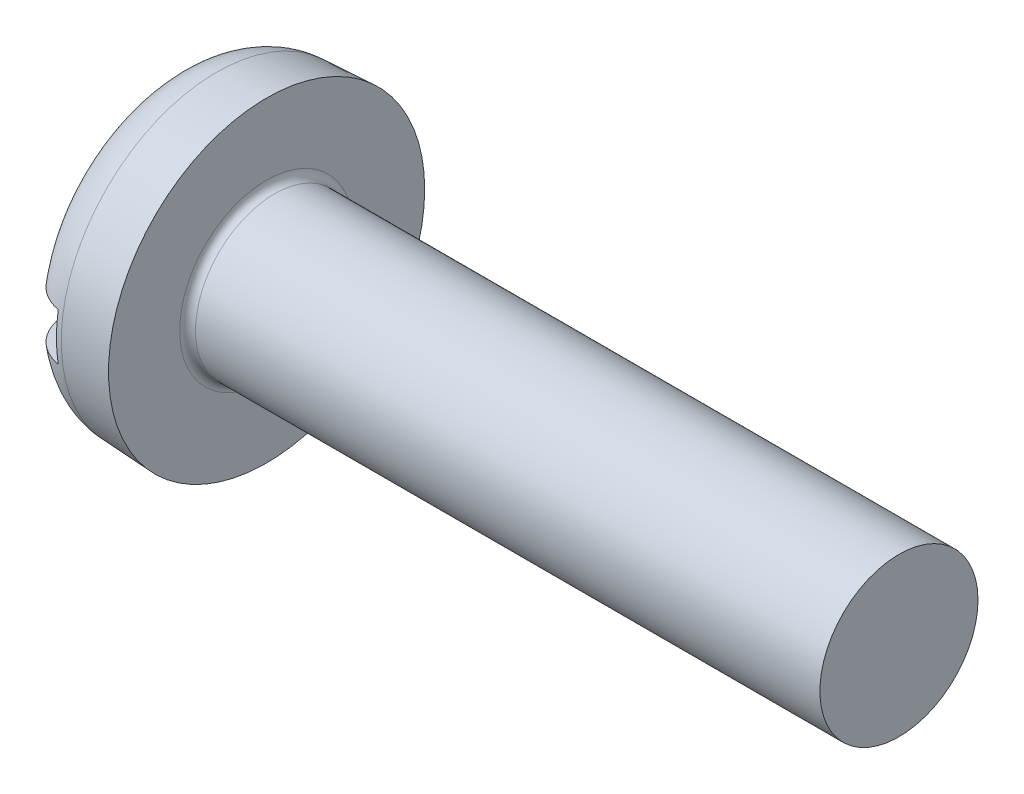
ISO-10303-21;
HEADER;
FILE_DESCRIPTION(('STEP AP214'),'2;1');
FILE_NAME('part.step','',(''),(''),'','','');
FILE_SCHEMA(('AUTOMOTIVE_DESIGN { 1 0 10303 214 1 1 1 1 }'));
ENDSEC;
DATA;
#1=APPLICATION_CONTEXT('core data for automotive mechanical design processes');
#2=APPLICATION_PROTOCOL_DEFINITION('international standard','automotive_design',2000,#1);
#3=PRODUCT_CONTEXT('',#1,'mechanical');
#4=PRODUCT('Part','Part','',(#3));
#5=PRODUCT_RELATED_PRODUCT_CATEGORY('part','',(#4));
#6=PRODUCT_DEFINITION_FORMATION('','',#4);
#7=PRODUCT_DEFINITION_CONTEXT('part definition',#1,'design');
#8=PRODUCT_DEFINITION('design','',#6,#7);
#9=PRODUCT_DEFINITION_SHAPE('','',#8);
#10=(LENGTH_UNIT() NAMED_UNIT(*) SI_UNIT(.MILLI.,.METRE.));
#11=(NAMED_UNIT(*) PLANE_ANGLE_UNIT() SI_UNIT($,.RADIAN.));
#12=(NAMED_UNIT(*) SI_UNIT($,.STERADIAN.) SOLID_ANGLE_UNIT());
#13=UNCERTAINTY_MEASURE_WITH_UNIT(LENGTH_MEASURE(1.E-05),#10,'distance_accuracy_value','');
#14=(GEOMETRIC_REPRESENTATION_CONTEXT(3) GLOBAL_UNCERTAINTY_ASSIGNED_CONTEXT((#13)) GLOBAL_UNIT_ASSIGNED_CONTEXT((#10,
#11,#12)) REPRESENTATION_CONTEXT('',''));
#15=CARTESIAN_POINT('',(0.,0.,0.));
#16=DIRECTION('',(0.,0.,1.));
#17=DIRECTION('',(1.,0.,0.));
#18=AXIS2_PLACEMENT_3D('',#15,#16,#17);
#19=CARTESIAN_POINT('',(0.,0.,0.));
#20=DIRECTION('',(1.,0.,0.));
#21=DIRECTION('',(0.,0.,-1.));
#22=AXIS2_PLACEMENT_3D('',#19,#20,#21);
#23=PLANE('',#22);
#24=CARTESIAN_POINT('',(0.,0.,0.));
#25=DIRECTION('',(1.,0.,0.));
#26=DIRECTION('',(0.,0.,-1.));
#27=AXIS2_PLACEMENT_3D('',#24,#25,#26);
#28=CIRCLE('',#27,2.73546384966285);
#29=CARTESIAN_POINT('',(0.,0.6,2.66885040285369));
#30=VERTEX_POINT('',#29);
#31=CARTESIAN_POINT('',(0.,0.6,-2.66885040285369));
#32=VERTEX_POINT('',#31);
#33=EDGE_CURVE('E104',#30,#32,#28,.F.);
#34=ORIENTED_EDGE('',*,*,#33,.T.);
#35=DIRECTION('',(0.,0.,1.));
#36=VECTOR('',#35,1.);
#37=CARTESIAN_POINT('',(0.,0.6,-4.));
#38=LINE('',#37,#36);
#39=EDGE_CURVE('E96',#32,#30,#38,.T.);
#40=ORIENTED_EDGE('',*,*,#39,.T.);
#41=EDGE_LOOP('',(#34,#40));
#42=FACE_BOUND('',#41,.T.);
#43=ADVANCED_FACE('F43',(#42),#23,.F.);
#44=CARTESIAN_POINT('',(2.4,0.,0.));
#45=DIRECTION('',(1.,0.,0.));
#46=DIRECTION('',(0.,0.,-1.));
#47=AXIS2_PLACEMENT_3D('',#44,#45,#46);
#48=PLANE('',#47);
#49=CARTESIAN_POINT('',(2.4,0.,0.));
#50=DIRECTION('',(1.,0.,0.));
#51=DIRECTION('',(0.,0.,-1.));
#52=AXIS2_PLACEMENT_3D('',#49,#50,#51);
#53=CIRCLE('',#52,2.2);
#54=CARTESIAN_POINT('',(2.4,0.,-2.2));
#55=VERTEX_POINT('',#54);
#56=EDGE_CURVE('E11',#55,#55,#53,.F.);
#57=ORIENTED_EDGE('',*,*,#56,.T.);
#58=EDGE_LOOP('',(#57));
#59=FACE_BOUND('',#58,.T.);
#60=CARTESIAN_POINT('',(2.4,0.,0.));
#61=DIRECTION('',(1.,0.,0.));
#62=DIRECTION('',(0.,0.,-1.));
#63=AXIS2_PLACEMENT_3D('',#60,#61,#62);
#64=CIRCLE('',#63,4.);
#65=CARTESIAN_POINT('',(2.4,0.,-4.));
#66=VERTEX_POINT('',#65);
#67=EDGE_CURVE('E178',#66,#66,#64,.T.);
#68=ORIENTED_EDGE('',*,*,#67,.T.);
#69=EDGE_LOOP('',(#68));
#70=FACE_BOUND('',#69,.T.);
#71=ADVANCED_FACE('F155',(#59,#70),#48,.T.);
#72=CARTESIAN_POINT('',(2.4,0.,0.));
#73=DIRECTION('',(1.,0.,0.));
#74=DIRECTION('',(0.,0.,-1.));
#75=AXIS2_PLACEMENT_3D('',#72,#73,#74);
#76=CONICAL_SURFACE('',#75,4.,0.05235987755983);
#77=CARTESIAN_POINT('',(1.13719685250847,0.,0.));
#78=DIRECTION('',(1.,0.,0.));
#79=DIRECTION('',(0.,0.,-1.));
#80=AXIS2_PLACEMENT_3D('',#77,#78,#79);
#81=CIRCLE('',#80,3.93381929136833);
#82=CARTESIAN_POINT('',(1.13719685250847,0.,-3.93381929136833));
#83=VERTEX_POINT('',#82);
#84=EDGE_CURVE('E108',#83,#83,#81,.T.);
#85=ORIENTED_EDGE('',*,*,#84,.T.);
#86=EDGE_LOOP('',(#85));
#87=FACE_BOUND('',#86,.T.);
#88=ORIENTED_EDGE('',*,*,#67,.F.);
#89=EDGE_LOOP('',(#88));
#90=FACE_BOUND('',#89,.T.);
#91=ADVANCED_FACE('F158',(#87,#90),#76,.T.);
#92=CARTESIAN_POINT('',(0.,-0.6,-2.66885040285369));
#93=VERTEX_POINT('',#92);
#94=CARTESIAN_POINT('',(0.,-0.6,2.66885040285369));
#95=VERTEX_POINT('',#94);
#96=EDGE_CURVE('E97',#93,#95,#28,.F.);
#97=ORIENTED_EDGE('',*,*,#96,.T.);
#98=DIRECTION('',(0.,0.,1.));
#99=VECTOR('',#98,1.);
#100=CARTESIAN_POINT('',(0.,-0.6,-4.));
#101=LINE('',#100,#99);
#102=EDGE_CURVE('E59',#93,#95,#101,.T.);
#103=ORIENTED_EDGE('',*,*,#102,.F.);
#104=EDGE_LOOP('',(#97,#103));
#105=FACE_BOUND('',#104,.T.);
#106=ADVANCED_FACE('F98',(#105),#23,.F.);
#107=CARTESIAN_POINT('',(18.4,0.,0.));
#108=DIRECTION('',(-1.,0.,0.));
#109=DIRECTION('',(0.,0.,1.));
#110=AXIS2_PLACEMENT_3D('',#107,#108,#109);
#111=CYLINDRICAL_SURFACE('',#110,2.);
#112=CARTESIAN_POINT('',(2.6,0.,0.));
#113=DIRECTION('',(1.,0.,0.));
#114=DIRECTION('',(0.,0.,-1.));
#115=AXIS2_PLACEMENT_3D('',#112,#113,#114);
#116=CIRCLE('',#115,2.);
#117=CARTESIAN_POINT('',(2.6,0.,-2.));
#118=VERTEX_POINT('',#117);
#119=EDGE_CURVE('E51',#118,#118,#116,.T.);
#120=ORIENTED_EDGE('',*,*,#119,.T.);
#121=EDGE_LOOP('',(#120));
#122=FACE_BOUND('',#121,.T.);
#123=CARTESIAN_POINT('',(18.4,0.,0.));
#124=DIRECTION('',(1.,0.,0.));
#125=DIRECTION('',(0.,0.,-1.));
#126=AXIS2_PLACEMENT_3D('',#123,#124,#125);
#127=CIRCLE('',#126,2.);
#128=CARTESIAN_POINT('',(18.4,0.,-2.));
#129=VERTEX_POINT('',#128);
#130=EDGE_CURVE('E181',#129,#129,#127,.T.);
#131=ORIENTED_EDGE('',*,*,#130,.F.);
#132=EDGE_LOOP('',(#131));
#133=FACE_BOUND('',#132,.T.);
#134=ADVANCED_FACE('F145',(#122,#133),#111,.T.);
#135=CARTESIAN_POINT('',(18.4,0.,0.));
#136=DIRECTION('',(1.,0.,0.));
#137=DIRECTION('',(0.,0.,-1.));
#138=AXIS2_PLACEMENT_3D('',#135,#136,#137);
#139=PLANE('',#138);
#140=ORIENTED_EDGE('',*,*,#130,.T.);
#141=EDGE_LOOP('',(#140));
#142=FACE_BOUND('',#141,.T.);
#143=ADVANCED_FACE('F166',(#142),#139,.T.);
#144=CARTESIAN_POINT('',(1.2,0.,0.));
#145=DIRECTION('',(1.,0.,0.));
#146=DIRECTION('',(0.,0.,-1.));
#147=AXIS2_PLACEMENT_3D('',#144,#145,#146);
#148=TOROIDAL_SURFACE('',#147,2.73546384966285,1.2);
#149=CARTESIAN_POINT('',(0.555933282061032,0.6,-3.69963697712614));
#150=CARTESIAN_POINT('',(0.612097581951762,0.6,-3.73582690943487));
#151=CARTESIAN_POINT('',(0.671342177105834,0.6,-3.76732291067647));
#152=CARTESIAN_POINT('',(0.794323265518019,0.6,-3.819955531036));
#153=CARTESIAN_POINT('',(0.858064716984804,0.6,-3.84108050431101));
#154=CARTESIAN_POINT('',(0.9881824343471,0.6,-3.87230357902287));
#155=CARTESIAN_POINT('',(1.05455798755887,0.6,-3.88240464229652));
#156=CARTESIAN_POINT('',(1.18804542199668,0.6,-3.89128144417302));
#157=CARTESIAN_POINT('',(1.2551571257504,0.6,-3.89005985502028));
#158=CARTESIAN_POINT('',(1.38803863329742,0.6,-3.87635428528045));
#159=CARTESIAN_POINT('',(1.45381153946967,0.6,-3.86390036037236));
#160=CARTESIAN_POINT('',(1.58233903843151,0.6,-3.82814160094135));
#161=CARTESIAN_POINT('',(1.6450935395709,0.6,-3.80483643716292));
#162=CARTESIAN_POINT('',(1.76590949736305,0.6,-3.74802277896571));
#163=CARTESIAN_POINT('',(1.82396400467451,0.6,-3.71449951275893));
#164=CARTESIAN_POINT('',(1.9336710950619,0.6,-3.63824661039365));
#165=CARTESIAN_POINT('',(1.98532354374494,0.6,-3.59551678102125));
#166=CARTESIAN_POINT('',(2.08116863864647,0.6,-3.50175800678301));
#167=CARTESIAN_POINT('',(2.12530590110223,0.6,-3.45067246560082));
#168=CARTESIAN_POINT('',(2.20450448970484,0.6,-3.34189724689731));
#169=CARTESIAN_POINT('',(2.23956537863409,0.6,-3.2842072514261));
#170=CARTESIAN_POINT('',(2.30012100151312,0.6,-3.1630762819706));
#171=CARTESIAN_POINT('',(2.32548641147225,0.6,-3.09957068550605));
#172=CARTESIAN_POINT('',(2.36541022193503,0.6,-2.96925219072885));
#173=CARTESIAN_POINT('',(2.37996773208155,0.6,-2.90243902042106));
#174=CARTESIAN_POINT('',(2.39816903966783,0.6,-2.7660769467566));
#175=CARTESIAN_POINT('',(2.40160452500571,0.6,-2.69650026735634));
#176=CARTESIAN_POINT('',(2.39701437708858,0.6,-2.55772811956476));
#177=CARTESIAN_POINT('',(2.38898742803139,0.6,-2.48853269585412));
#178=CARTESIAN_POINT('',(2.36150000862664,0.6,-2.3508493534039));
#179=CARTESIAN_POINT('',(2.34178924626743,0.6,-2.28241138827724));
#180=CARTESIAN_POINT('',(2.29136170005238,0.6,-2.14971365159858));
#181=CARTESIAN_POINT('',(2.26064332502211,0.6,-2.08545448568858));
#182=CARTESIAN_POINT('',(2.18841822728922,0.6,-1.96178172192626));
#183=CARTESIAN_POINT('',(2.14673117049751,0.6,-1.90247329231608));
#184=CARTESIAN_POINT('',(2.05392478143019,0.6,-1.79173471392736));
#185=CARTESIAN_POINT('',(2.00280414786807,0.6,-1.74030565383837));
#186=CARTESIAN_POINT('',(1.8928415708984,0.6,-1.64738954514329));
#187=CARTESIAN_POINT('',(1.83405992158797,0.6,-1.60583135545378));
#188=CARTESIAN_POINT('',(1.71003406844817,0.6,-1.53383571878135));
#189=CARTESIAN_POINT('',(1.64479280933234,0.6,-1.50339323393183));
#190=CARTESIAN_POINT('',(1.51349434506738,0.6,-1.45646687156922));
#191=CARTESIAN_POINT('',(1.4476792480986,0.6,-1.43930752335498));
#192=CARTESIAN_POINT('',(1.31404018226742,0.6,-1.41721626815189));
#193=CARTESIAN_POINT('',(1.24621741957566,0.6,-1.41227716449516));
#194=CARTESIAN_POINT('',(1.1155159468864,0.6,-1.41481386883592));
#195=CARTESIAN_POINT('',(1.05261935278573,0.6,-1.42145563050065));
#196=CARTESIAN_POINT('',(0.928843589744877,0.6,-1.44521901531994));
#197=CARTESIAN_POINT('',(0.867964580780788,0.6,-1.46234146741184));
#198=CARTESIAN_POINT('',(0.7498264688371,0.6,-1.50626762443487));
#199=CARTESIAN_POINT('',(0.692567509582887,0.6,-1.53307171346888));
#200=CARTESIAN_POINT('',(0.582966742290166,0.6,-1.59532349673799));
#201=CARTESIAN_POINT('',(0.530626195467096,0.6,-1.63077339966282));
#202=CARTESIAN_POINT('',(0.428649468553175,0.6,-1.71181800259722));
#203=CARTESIAN_POINT('',(0.379425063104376,0.6,-1.75793082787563));
#204=CARTESIAN_POINT('',(0.28887643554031,0.6,-1.85735292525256));
#205=CARTESIAN_POINT('',(0.247554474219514,0.6,-1.91066424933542));
#206=CARTESIAN_POINT('',(0.171571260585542,0.6,-2.0264003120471));
#207=CARTESIAN_POINT('',(0.137443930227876,0.6,-2.0891764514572));
#208=CARTESIAN_POINT('',(0.0800179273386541,0.6,-2.21950517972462));
#209=CARTESIAN_POINT('',(0.0567205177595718,0.6,-2.28705832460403));
#210=CARTESIAN_POINT('',(0.0213897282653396,0.6,-2.42619403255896));
#211=CARTESIAN_POINT('',(0.00953960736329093,0.6,-2.49782331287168));
#212=CARTESIAN_POINT('',(-0.0017807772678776,0.6,-2.64205497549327));
#213=CARTESIAN_POINT('',(-0.00125216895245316,0.6,-2.71465726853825));
#214=CARTESIAN_POINT('',(0.0122145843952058,0.6,-2.85765418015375));
#215=CARTESIAN_POINT('',(0.0249745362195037,0.6,-2.92806552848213));
#216=CARTESIAN_POINT('',(0.0624173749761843,0.6,-3.06566752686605));
#217=CARTESIAN_POINT('',(0.0871019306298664,0.6,-3.13285772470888));
#218=CARTESIAN_POINT('',(0.147094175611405,0.6,-3.26049536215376));
#219=CARTESIAN_POINT('',(0.18215501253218,0.6,-3.32105900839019));
#220=CARTESIAN_POINT('',(0.262119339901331,0.6,-3.43522071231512));
#221=CARTESIAN_POINT('',(0.307009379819,0.6,-3.488828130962));
#222=CARTESIAN_POINT('',(0.386440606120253,0.6,-3.56852120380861));
#223=CARTESIAN_POINT('',(0.418349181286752,0.6,-3.59727767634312));
#224=CARTESIAN_POINT('',(0.485059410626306,0.6,-3.65121381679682));
#225=CARTESIAN_POINT('',(0.519861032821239,0.6,-3.67639352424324));
#226=CARTESIAN_POINT('',(0.555933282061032,0.6,-3.69963697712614));
#227=B_SPLINE_CURVE_WITH_KNOTS('',3,(#149,#150,#151,#152,#153,#154,#155,#156,#157,#158,#159,
#160,#161,#162,#163,#164,#165,#166,#167,#168,#169,#170,#171,#172,#173,#174,#175,#176,#177,#178,
#179,#180,#181,#182,#183,#184,#185,#186,#187,#188,#189,#190,#191,#192,#193,#194,#195,#196,#197,
#198,#199,#200,#201,#202,#203,#204,#205,#206,#207,#208,#209,#210,#211,#212,#213,#214,#215,#216,
#217,#218,#219,#220,#221,#222,#223,#224,#225,#226),.UNSPECIFIED.,.T.,.F.,(4,2,2,2,2,2,2,2,2,2,2,
2,2,2,2,2,2,2,2,2,2,2,2,2,2,2,2,2,2,2,2,2,2,2,2,2,2,2,4),(0.,0.20028700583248,0.40079840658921,
0.601255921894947,0.80166612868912,1.00154166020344,1.20142325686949,1.40159519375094,
1.60177133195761,1.80336420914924,2.00496679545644,2.2091717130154,2.41339345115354,
2.62141871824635,2.82946786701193,3.04214366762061,3.25485022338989,3.47129985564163,
3.68777936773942,3.90264781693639,4.11741876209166,4.32038062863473,4.52322293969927,
4.71205300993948,4.90089801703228,5.08975051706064,5.27865131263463,5.48012321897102,
5.68165267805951,5.89502164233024,6.10841548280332,6.32517154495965,6.54190785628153,
6.75553387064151,6.96918978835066,7.17812345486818,7.38677297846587,7.51541132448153,
7.64404824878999),.UNSPECIFIED.);
#228=CARTESIAN_POINT('',(1.,0.6,-3.87247355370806));
#229=VERTEX_POINT('',#228);
#230=EDGE_CURVE('E132',#32,#229,#227,.T.);
#231=ORIENTED_EDGE('',*,*,#230,.F.);
#232=ORIENTED_EDGE('',*,*,#33,.F.);
#233=CARTESIAN_POINT('',(0.515582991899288,0.6,1.64369364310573));
#234=CARTESIAN_POINT('',(0.568128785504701,0.6,1.60485500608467));
#235=CARTESIAN_POINT('',(0.623793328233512,0.6,1.57018612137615));
#236=CARTESIAN_POINT('',(0.740097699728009,0.6,1.51044666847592));
#237=CARTESIAN_POINT('',(0.800739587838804,0.6,1.48538009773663));
#238=CARTESIAN_POINT('',(0.925598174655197,0.6,1.44591759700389));
#239=CARTESIAN_POINT('',(0.989823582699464,0.6,1.43154900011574));
#240=CARTESIAN_POINT('',(1.11978889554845,0.6,1.41436102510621));
#241=CARTESIAN_POINT('',(1.18552814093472,0.6,1.41153671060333));
#242=CARTESIAN_POINT('',(1.31369263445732,0.6,1.4174549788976));
#243=CARTESIAN_POINT('',(1.37614083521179,0.6,1.42571534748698));
#244=CARTESIAN_POINT('',(1.49878010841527,0.6,1.4525366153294));
#245=CARTESIAN_POINT('',(1.55897082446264,0.6,1.47109913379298));
#246=CARTESIAN_POINT('',(1.67598712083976,0.6,1.51786066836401));
#247=CARTESIAN_POINT('',(1.73278411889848,0.6,1.5461308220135));
#248=CARTESIAN_POINT('',(1.84124862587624,0.6,1.61120742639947));
#249=CARTESIAN_POINT('',(1.89291480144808,0.6,1.64801608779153));
#250=CARTESIAN_POINT('',(1.99339521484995,0.6,1.731821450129));
#251=CARTESIAN_POINT('',(2.04177148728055,0.6,1.77934340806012));
#252=CARTESIAN_POINT('',(2.13038749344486,0.6,1.88145058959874));
#253=CARTESIAN_POINT('',(2.17062497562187,0.6,1.93603776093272));
#254=CARTESIAN_POINT('',(2.24403971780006,0.6,2.05407203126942));
#255=CARTESIAN_POINT('',(2.27669611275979,0.6,2.11784393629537));
#256=CARTESIAN_POINT('',(2.33099926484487,0.6,2.24991940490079));
#257=CARTESIAN_POINT('',(2.35264491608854,0.6,2.31822342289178));
#258=CARTESIAN_POINT('',(2.38444660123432,0.6,2.45837823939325));
#259=CARTESIAN_POINT('',(2.3944534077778,0.6,2.53026303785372));
#260=CARTESIAN_POINT('',(2.40205371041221,0.6,2.67468993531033));
#261=CARTESIAN_POINT('',(2.39964795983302,0.6,2.74723199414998));
#262=CARTESIAN_POINT('',(2.38248365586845,0.6,2.88970050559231));
#263=CARTESIAN_POINT('',(2.36791749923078,0.6,2.95965008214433));
#264=CARTESIAN_POINT('',(2.32697297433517,0.6,3.09600502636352));
#265=CARTESIAN_POINT('',(2.30059599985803,0.6,3.16241081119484));
#266=CARTESIAN_POINT('',(2.23743033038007,0.6,3.28819082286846));
#267=CARTESIAN_POINT('',(2.20089069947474,0.6,3.34769014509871));
#268=CARTESIAN_POINT('',(2.11815515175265,0.6,3.45954830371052));
#269=CARTESIAN_POINT('',(2.0719602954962,0.6,3.51190792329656));
#270=CARTESIAN_POINT('',(1.9722029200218,0.6,3.60693861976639));
#271=CARTESIAN_POINT('',(1.91880027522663,0.6,3.64977757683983));
#272=CARTESIAN_POINT('',(1.80548008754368,0.6,3.72573720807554));
#273=CARTESIAN_POINT('',(1.74556306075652,0.6,3.75885865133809));
#274=CARTESIAN_POINT('',(1.62178095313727,0.6,3.81399882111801));
#275=CARTESIAN_POINT('',(1.55797916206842,0.6,3.83615969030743));
#276=CARTESIAN_POINT('',(1.42754632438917,0.6,3.8693676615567));
#277=CARTESIAN_POINT('',(1.3609154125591,0.6,3.88041529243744));
#278=CARTESIAN_POINT('',(1.22723269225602,0.6,3.89102498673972));
#279=CARTESIAN_POINT('',(1.16018742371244,0.6,3.89066962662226));
#280=CARTESIAN_POINT('',(1.02711260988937,0.6,3.8786886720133));
#281=CARTESIAN_POINT('',(0.9610830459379,0.6,3.86706328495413));
#282=CARTESIAN_POINT('',(0.832014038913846,0.6,3.83291537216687));
#283=CARTESIAN_POINT('',(0.768970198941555,0.6,3.8104094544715));
#284=CARTESIAN_POINT('',(0.647534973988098,0.6,3.75517384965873));
#285=CARTESIAN_POINT('',(0.58914362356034,0.6,3.7224440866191));
#286=CARTESIAN_POINT('',(0.478404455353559,0.6,3.64756873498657));
#287=CARTESIAN_POINT('',(0.426081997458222,0.6,3.60538565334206));
#288=CARTESIAN_POINT('',(0.329178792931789,0.6,3.51291088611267));
#289=CARTESIAN_POINT('',(0.284598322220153,0.6,3.46261891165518));
#290=CARTESIAN_POINT('',(0.203960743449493,0.6,3.35484539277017));
#291=CARTESIAN_POINT('',(0.167990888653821,0.6,3.29729858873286));
#292=CARTESIAN_POINT('',(0.106054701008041,0.6,3.17705572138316));
#293=CARTESIAN_POINT('',(0.0800890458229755,0.6,3.1143593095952));
#294=CARTESIAN_POINT('',(0.0384437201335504,0.6,2.9845572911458));
#295=CARTESIAN_POINT('',(0.0229313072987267,0.6,2.91739805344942));
#296=CARTESIAN_POINT('',(0.0031545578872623,0.6,2.78144902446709));
#297=CARTESIAN_POINT('',(-0.00110911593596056,0.6,2.71265913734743));
#298=CARTESIAN_POINT('',(0.00162760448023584,0.6,2.57388041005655));
#299=CARTESIAN_POINT('',(0.00886300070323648,0.6,2.50389622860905));
#300=CARTESIAN_POINT('',(0.0347230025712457,0.6,2.3660479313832));
#301=CARTESIAN_POINT('',(0.053351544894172,0.6,2.29818455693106));
#302=CARTESIAN_POINT('',(0.101943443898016,0.6,2.16494106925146));
#303=CARTESIAN_POINT('',(0.132148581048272,0.6,2.09964917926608));
#304=CARTESIAN_POINT('',(0.202971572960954,0.6,1.97502953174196));
#305=CARTESIAN_POINT('',(0.243580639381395,0.6,1.91569679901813));
#306=CARTESIAN_POINT('',(0.321961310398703,0.6,1.81959577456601));
#307=CARTESIAN_POINT('',(0.35757140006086,0.6,1.78104429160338));
#308=CARTESIAN_POINT('',(0.433313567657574,0.6,1.70866604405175));
#309=CARTESIAN_POINT('',(0.473445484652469,0.6,1.67483911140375));
#310=CARTESIAN_POINT('',(0.515582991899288,0.6,1.64369364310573));
#311=B_SPLINE_CURVE_WITH_KNOTS('',3,(#233,#234,#235,#236,#237,#238,#239,#240,#241,#242,#243,
#244,#245,#246,#247,#248,#249,#250,#251,#252,#253,#254,#255,#256,#257,#258,#259,#260,#261,#262,
#263,#264,#265,#266,#267,#268,#269,#270,#271,#272,#273,#274,#275,#276,#277,#278,#279,#280,#281,
#282,#283,#284,#285,#286,#287,#288,#289,#290,#291,#292,#293,#294,#295,#296,#297,#298,#299,#300,
#301,#302,#303,#304,#305,#306,#307,#308,#309,#310),.UNSPECIFIED.,.T.,.F.,(4,2,2,2,2,2,2,2,2,2,2,
2,2,2,2,2,2,2,2,2,2,2,2,2,2,2,2,2,2,2,2,2,2,2,2,2,2,2,4),(0.,0.195852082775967,
0.391785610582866,0.588218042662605,0.784566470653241,0.972644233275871,1.16075156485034,
1.35026785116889,1.53983325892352,1.74238727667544,1.94499725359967,2.15894126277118,
2.37290675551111,2.58958637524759,2.80625284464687,3.01955487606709,3.2328317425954,
3.44128327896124,3.64971193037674,3.85410717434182,4.05848623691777,4.26014035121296,
4.46178486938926,4.66196948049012,4.86215040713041,5.06202673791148,5.26190455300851,
5.46258959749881,5.6632817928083,5.86592886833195,6.06858966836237,6.27442069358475,
6.48026384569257,6.69036810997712,6.90054501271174,7.11537441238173,7.3300229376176,
7.48708617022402,7.64414381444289),.UNSPECIFIED.);
#312=CARTESIAN_POINT('',(1.,0.6,3.87247355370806));
#313=VERTEX_POINT('',#312);
#314=EDGE_CURVE('E94',#313,#30,#311,.T.);
#315=ORIENTED_EDGE('',*,*,#314,.F.);
#316=CARTESIAN_POINT('',(1.,0.,0.));
#317=DIRECTION('',(1.,0.,0.));
#318=DIRECTION('',(0.,0.,-1.));
#319=AXIS2_PLACEMENT_3D('',#316,#317,#318);
#320=CIRCLE('',#319,3.91867980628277);
#321=CARTESIAN_POINT('',(1.,-0.6,3.87247355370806));
#322=VERTEX_POINT('',#321);
#323=EDGE_CURVE('E68',#322,#313,#320,.F.);
#324=ORIENTED_EDGE('',*,*,#323,.F.);
#325=CARTESIAN_POINT('',(0.515582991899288,-0.6,1.64369364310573));
#326=CARTESIAN_POINT('',(0.458216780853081,-0.6,1.68610027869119));
#327=CARTESIAN_POINT('',(0.404486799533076,-0.6,1.73354170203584));
#328=CARTESIAN_POINT('',(0.305710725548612,-0.6,1.83684214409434));
#329=CARTESIAN_POINT('',(0.260681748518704,-0.6,1.89271737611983));
#330=CARTESIAN_POINT('',(0.180588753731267,-0.6,2.01107750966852));
#331=CARTESIAN_POINT('',(0.145508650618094,-0.6,2.07355151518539));
#332=CARTESIAN_POINT('',(0.0861851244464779,-0.6,2.2034121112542));
#333=CARTESIAN_POINT('',(0.0619367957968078,-0.6,2.27079646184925));
#334=CARTESIAN_POINT('',(0.0247322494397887,-0.6,2.40960591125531));
#335=CARTESIAN_POINT('',(0.0119339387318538,-0.6,2.48107347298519));
#336=CARTESIAN_POINT('',(-0.00130824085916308,-0.6,2.62515575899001));
#337=CARTESIAN_POINT('',(-0.00175150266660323,-0.6,2.6977705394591));
#338=CARTESIAN_POINT('',(0.00979769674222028,-0.6,2.84101713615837));
#339=CARTESIAN_POINT('',(0.0216215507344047,-0.6,2.91166248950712));
#340=CARTESIAN_POINT('',(0.0572406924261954,-0.6,3.04987000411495));
#341=CARTESIAN_POINT('',(0.0810344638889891,-0.6,3.1174325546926));
#342=CARTESIAN_POINT('',(0.139334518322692,-0.6,3.2459308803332));
#343=CARTESIAN_POINT('',(0.173587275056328,-0.6,3.30698169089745));
#344=CARTESIAN_POINT('',(0.252054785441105,-0.6,3.42230688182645));
#345=CARTESIAN_POINT('',(0.296268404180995,-0.6,3.47658203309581));
#346=CARTESIAN_POINT('',(0.392437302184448,-0.6,3.57567757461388));
#347=CARTESIAN_POINT('',(0.444220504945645,-0.6,3.62066501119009));
#348=CARTESIAN_POINT('',(0.554696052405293,-0.6,3.70115846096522));
#349=CARTESIAN_POINT('',(0.613387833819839,-0.6,3.73666524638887));
#350=CARTESIAN_POINT('',(0.735119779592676,-0.6,3.79668379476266));
#351=CARTESIAN_POINT('',(0.798087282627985,-0.6,3.82134299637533));
#352=CARTESIAN_POINT('',(0.927287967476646,-0.6,3.85964469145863));
#353=CARTESIAN_POINT('',(0.993520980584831,-0.6,3.87328775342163));
#354=CARTESIAN_POINT('',(1.12680970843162,-0.6,3.88908201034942));
#355=CARTESIAN_POINT('',(1.1938547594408,-0.6,3.89132332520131));
#356=CARTESIAN_POINT('',(1.3273648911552,-0.6,3.8844911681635));
#357=CARTESIAN_POINT('',(1.39382998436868,-0.6,3.87541794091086));
#358=CARTESIAN_POINT('',(1.52414639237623,-0.6,3.84625981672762));
#359=CARTESIAN_POINT('',(1.5880030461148,-0.6,3.82619876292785));
#360=CARTESIAN_POINT('',(1.71145793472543,-0.6,3.77567575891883));
#361=CARTESIAN_POINT('',(1.77105614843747,-0.599999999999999,3.74521375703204));
#362=CARTESIAN_POINT('',(1.88453260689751,-0.599999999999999,3.67466350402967));
#363=CARTESIAN_POINT('',(1.93839071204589,-0.599999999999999,3.63454287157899));
#364=CARTESIAN_POINT('',(2.03868103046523,-0.599999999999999,3.54590356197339));
#365=CARTESIAN_POINT('',(2.08511300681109,-0.599999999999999,3.49738461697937));
#366=CARTESIAN_POINT('',(2.16970278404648,-0.599999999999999,3.39287085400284));
#367=CARTESIAN_POINT('',(2.20778164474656,-0.599999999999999,3.33681216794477));
#368=CARTESIAN_POINT('',(2.27414536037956,-0.599999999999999,3.21917351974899));
#369=CARTESIAN_POINT('',(2.30242962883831,-0.599999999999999,3.15759322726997));
#370=CARTESIAN_POINT('',(2.34887457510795,-0.599999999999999,3.0296840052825));
#371=CARTESIAN_POINT('',(2.36687749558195,-0.599999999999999,2.96329782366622));
#372=CARTESIAN_POINT('',(2.39172314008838,-0.599999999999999,2.82847203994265));
#373=CARTESIAN_POINT('',(2.39856480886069,-0.599999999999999,2.76003224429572));
#374=CARTESIAN_POINT('',(2.40105335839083,-0.599999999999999,2.62155982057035));
#375=CARTESIAN_POINT('',(2.39647001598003,-0.599999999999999,2.55152307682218));
#376=CARTESIAN_POINT('',(2.37587536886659,-0.599999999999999,2.41315158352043));
#377=CARTESIAN_POINT('',(2.35986267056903,-0.599999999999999,2.34481704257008));
#378=CARTESIAN_POINT('',(2.31645872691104,-0.599999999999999,2.21019244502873));
#379=CARTESIAN_POINT('',(2.28882422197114,-0.599999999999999,2.14398076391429));
#380=CARTESIAN_POINT('',(2.22296516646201,-0.599999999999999,2.01704107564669));
#381=CARTESIAN_POINT('',(2.18473885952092,-0.599999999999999,1.95631398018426));
#382=CARTESIAN_POINT('',(2.09818730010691,-0.599999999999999,1.84138532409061));
#383=CARTESIAN_POINT('',(2.04974718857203,-0.599999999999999,1.78727009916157));
#384=CARTESIAN_POINT('',(1.94428163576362,-0.599999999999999,1.6881426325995));
#385=CARTESIAN_POINT('',(1.88725605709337,-0.599999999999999,1.64313053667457));
#386=CARTESIAN_POINT('',(1.76747975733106,-0.599999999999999,1.5648167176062));
#387=CARTESIAN_POINT('',(1.7048877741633,-0.6,1.53127307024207));
#388=CARTESIAN_POINT('',(1.57467690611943,-0.6,1.47606198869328));
#389=CARTESIAN_POINT('',(1.50706164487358,-0.6,1.4543860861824));
#390=CARTESIAN_POINT('',(1.37369033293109,-0.6,1.42514404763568));
#391=CARTESIAN_POINT('',(1.30812360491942,-0.6,1.41671398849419));
#392=CARTESIAN_POINT('',(1.17652664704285,-0.6,1.4116726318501));
#393=CARTESIAN_POINT('',(1.11049644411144,-0.6,1.41506065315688));
#394=CARTESIAN_POINT('',(0.983521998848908,-0.6,1.43296581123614));
#395=CARTESIAN_POINT('',(0.922492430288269,-0.6,1.44689126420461));
#396=CARTESIAN_POINT('',(0.803577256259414,-0.6,1.48449116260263));
#397=CARTESIAN_POINT('',(0.7456883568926,-0.6,1.50815516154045));
#398=CARTESIAN_POINT('',(0.659511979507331,-0.6,1.55158165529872));
#399=CARTESIAN_POINT('',(0.629644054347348,-0.6,1.56829420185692));
#400=CARTESIAN_POINT('',(0.571433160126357,-0.6,1.60418332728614));
#401=CARTESIAN_POINT('',(0.543090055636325,-0.6,1.62335968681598));
#402=CARTESIAN_POINT('',(0.515582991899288,-0.6,1.64369364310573));
#403=B_SPLINE_CURVE_WITH_KNOTS('',3,(#325,#326,#327,#328,#329,#330,#331,#332,#333,#334,#335,
#336,#337,#338,#339,#340,#341,#342,#343,#344,#345,#346,#347,#348,#349,#350,#351,#352,#353,#354,
#355,#356,#357,#358,#359,#360,#361,#362,#363,#364,#365,#366,#367,#368,#369,#370,#371,#372,#373,
#374,#375,#376,#377,#378,#379,#380,#381,#382,#383,#384,#385,#386,#387,#388,#389,#390,#391,#392,
#393,#394,#395,#396,#397,#398,#399,#400,#401,#402),.UNSPECIFIED.,.T.,.F.,(4,2,2,2,2,2,2,2,2,2,2,
2,2,2,2,2,2,2,2,2,2,2,2,2,2,2,2,2,2,2,2,2,2,2,2,2,2,2,4),(0.,0.213886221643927,
0.428188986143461,0.64214326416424,0.856000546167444,1.07276359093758,1.28953728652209,
1.50337047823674,1.71717659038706,1.92616391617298,2.13512744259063,2.33992141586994,
2.54469870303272,2.7465995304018,2.94848993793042,3.14878208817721,3.34906990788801,
3.5489248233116,3.74878073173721,3.94931623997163,4.1498581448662,4.35222058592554,
4.55459514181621,4.75999682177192,4.96541792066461,5.1750117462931,5.38463113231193,
5.59887553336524,5.81315548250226,6.02998757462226,6.2468231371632,6.45875238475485,
6.67053021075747,6.86781811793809,7.06509465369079,7.2520473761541,7.43880007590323,
7.54136751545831,7.6439258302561),.UNSPECIFIED.);
#404=EDGE_CURVE('E101',#95,#322,#403,.T.);
#405=ORIENTED_EDGE('',*,*,#404,.F.);
#406=ORIENTED_EDGE('',*,*,#96,.F.);
#407=CARTESIAN_POINT('',(0.555933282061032,-0.6,-3.69963697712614));
#408=CARTESIAN_POINT('',(0.498937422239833,-0.6,-3.66290380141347));
#409=CARTESIAN_POINT('',(0.445028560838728,-0.6,-3.62128013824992));
#410=CARTESIAN_POINT('',(0.344954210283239,-0.6,-3.52950231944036));
#411=CARTESIAN_POINT('',(0.298799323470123,-0.6,-3.47933666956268));
#412=CARTESIAN_POINT('',(0.21558827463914,-0.6,-3.37204086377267));
#413=CARTESIAN_POINT('',(0.178522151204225,-0.6,-3.31491843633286));
#414=CARTESIAN_POINT('',(0.114394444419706,-0.6,-3.1953376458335));
#415=CARTESIAN_POINT('',(0.0873303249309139,-0.6,-3.13288064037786));
#416=CARTESIAN_POINT('',(0.0435782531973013,-0.6,-3.00362580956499));
#417=CARTESIAN_POINT('',(0.02701440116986,-0.6,-2.93678600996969));
#418=CARTESIAN_POINT('',(0.0050972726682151,-0.6,-2.80129307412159));
#419=CARTESIAN_POINT('',(-0.000254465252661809,-0.6,-2.73263969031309));
#420=CARTESIAN_POINT('',(0.000278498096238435,-0.6,-2.59396243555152));
#421=CARTESIAN_POINT('',(0.00639708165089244,-0.6,-2.5239394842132));
#422=CARTESIAN_POINT('',(0.0300407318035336,-0.6,-2.38584740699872));
#423=CARTESIAN_POINT('',(0.047567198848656,-0.6,-2.31777852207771));
#424=CARTESIAN_POINT('',(0.0939708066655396,-0.6,-2.18395044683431));
#425=CARTESIAN_POINT('',(0.123088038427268,-0.6,-2.11827444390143));
#426=CARTESIAN_POINT('',(0.191818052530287,-0.6,-1.99265287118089));
#427=CARTESIAN_POINT('',(0.231432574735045,-0.6,-1.93270825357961));
#428=CARTESIAN_POINT('',(0.320590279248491,-0.6,-1.81967842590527));
#429=CARTESIAN_POINT('',(0.370233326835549,-0.6,-1.76667183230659));
#430=CARTESIAN_POINT('',(0.477922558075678,-0.6,-1.66998740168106));
#431=CARTESIAN_POINT('',(0.535968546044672,-0.6,-1.62630934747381));
#432=CARTESIAN_POINT('',(0.657344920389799,-0.6,-1.55097417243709));
#433=CARTESIAN_POINT('',(0.720499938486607,-0.6,-1.51903552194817));
#434=CARTESIAN_POINT('',(0.851546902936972,-0.6,-1.46713651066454));
#435=CARTESIAN_POINT('',(0.919435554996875,-0.6,-1.44716791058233));
#436=CARTESIAN_POINT('',(1.05290600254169,-0.6,-1.42127211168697));
#437=CARTESIAN_POINT('',(1.11831621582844,-0.6,-1.41445922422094));
#438=CARTESIAN_POINT('',(1.24929905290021,-0.6,-1.41254254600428));
#439=CARTESIAN_POINT('',(1.31487162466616,-0.6,-1.41743539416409));
#440=CARTESIAN_POINT('',(1.44098108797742,-0.6,-1.43812410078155));
#441=CARTESIAN_POINT('',(1.50160799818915,-0.6,-1.45337992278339));
#442=CARTESIAN_POINT('',(1.61958351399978,-0.6,-1.49351012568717));
#443=CARTESIAN_POINT('',(1.67693148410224,-0.6,-1.5183863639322));
#444=CARTESIAN_POINT('',(1.78895454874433,-0.6,-1.57780671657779));
#445=CARTESIAN_POINT('',(1.8434658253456,-0.599999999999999,-1.61265875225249));
#446=CARTESIAN_POINT('',(1.94638252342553,-0.599999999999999,-1.69043538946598));
#447=CARTESIAN_POINT('',(1.99478618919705,-0.599999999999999,-1.73336230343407));
#448=CARTESIAN_POINT('',(2.08771342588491,-0.599999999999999,-1.82940847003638));
#449=CARTESIAN_POINT('',(2.13171077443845,-0.599999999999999,-1.88303752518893));
#450=CARTESIAN_POINT('',(2.21051745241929,-0.599999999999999,-1.99667164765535));
#451=CARTESIAN_POINT('',(2.24532465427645,-0.599999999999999,-2.05667818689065));
#452=CARTESIAN_POINT('',(2.30611511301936,-0.599999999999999,-2.18410590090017));
#453=CARTESIAN_POINT('',(2.331670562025,-0.599999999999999,-2.25173178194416));
#454=CARTESIAN_POINT('',(2.37107580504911,-0.599999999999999,-2.39031673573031));
#455=CARTESIAN_POINT('',(2.38492519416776,-0.599999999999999,-2.46127592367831));
#456=CARTESIAN_POINT('',(2.40040983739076,-0.599999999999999,-2.60455377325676));
#457=CARTESIAN_POINT('',(2.40203984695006,-0.599999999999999,-2.67687300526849));
#458=CARTESIAN_POINT('',(2.39287751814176,-0.599999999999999,-2.82072380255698));
#459=CARTESIAN_POINT('',(2.38208631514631,-0.599999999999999,-2.89225543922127));
#460=CARTESIAN_POINT('',(2.34859761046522,-0.599999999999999,-3.03097741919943));
#461=CARTESIAN_POINT('',(2.32614021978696,-0.599999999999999,-3.09822569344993));
#462=CARTESIAN_POINT('',(2.27000037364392,-0.599999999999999,-3.22786373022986));
#463=CARTESIAN_POINT('',(2.23631924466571,-0.599999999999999,-3.29025406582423));
#464=CARTESIAN_POINT('',(2.15950659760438,-0.599999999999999,-3.40693738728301));
#465=CARTESIAN_POINT('',(2.11660112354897,-0.599999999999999,-3.46137921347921));
#466=CARTESIAN_POINT('',(2.02211127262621,-0.599999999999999,-3.56212454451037));
#467=CARTESIAN_POINT('',(1.97052774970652,-0.599999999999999,-3.6084288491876));
#468=CARTESIAN_POINT('',(1.86112446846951,-0.599999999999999,-3.69074819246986));
#469=CARTESIAN_POINT('',(1.80342879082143,-0.6,-3.72692819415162));
#470=CARTESIAN_POINT('',(1.68273146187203,-0.6,-3.7889585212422));
#471=CARTESIAN_POINT('',(1.61973039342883,-0.6,-3.81480997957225));
#472=CARTESIAN_POINT('',(1.49098082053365,-0.6,-3.85516745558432));
#473=CARTESIAN_POINT('',(1.42527157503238,-0.6,-3.86979880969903));
#474=CARTESIAN_POINT('',(1.29230746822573,-0.6,-3.88776030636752));
#475=CARTESIAN_POINT('',(1.22505226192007,-0.6,-3.89108790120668));
#476=CARTESIAN_POINT('',(1.09127399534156,-0.6,-3.88634979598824));
#477=CARTESIAN_POINT('',(1.02474897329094,-0.6,-3.87833832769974));
#478=CARTESIAN_POINT('',(0.894049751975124,-0.6,-3.85126016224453));
#479=CARTESIAN_POINT('',(0.829872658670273,-0.6,-3.83220759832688));
#480=CARTESIAN_POINT('',(0.73077958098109,-0.6,-3.79348215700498));
#481=CARTESIAN_POINT('',(0.694514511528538,-0.6,-3.77716792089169));
#482=CARTESIAN_POINT('',(0.623790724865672,-0.6,-3.74100786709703));
#483=CARTESIAN_POINT('',(0.589331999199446,-0.6,-3.72116206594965));
#484=CARTESIAN_POINT('',(0.555933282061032,-0.6,-3.69963697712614));
#485=B_SPLINE_CURVE_WITH_KNOTS('',3,(#407,#408,#409,#410,#411,#412,#413,#414,#415,#416,#417,
#418,#419,#420,#421,#422,#423,#424,#425,#426,#427,#428,#429,#430,#431,#432,#433,#434,#435,#436,
#437,#438,#439,#440,#441,#442,#443,#444,#445,#446,#447,#448,#449,#450,#451,#452,#453,#454,#455,
#456,#457,#458,#459,#460,#461,#462,#463,#464,#465,#466,#467,#468,#469,#470,#471,#472,#473,#474,
#475,#476,#477,#478,#479,#480,#481,#482,#483,#484),.UNSPECIFIED.,.T.,.F.,(4,2,2,2,2,2,2,2,2,2,2,
2,2,2,2,2,2,2,2,2,2,2,2,2,2,2,2,2,2,2,2,2,2,2,2,2,2,2,4),(0.,0.203274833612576,
0.406825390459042,0.610151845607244,0.813426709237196,1.01906131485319,1.22472413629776,
1.43462613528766,1.64455390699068,1.85907745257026,2.07363657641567,2.29044814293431,
2.50725466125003,2.7184572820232,2.92951435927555,3.12578549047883,3.32200027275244,
3.50870327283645,3.69544233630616,3.88871771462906,4.08204852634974,4.28922653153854,
4.49645245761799,4.71230774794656,4.92817050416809,5.1441259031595,5.36006156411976,
5.57171932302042,5.78335207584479,5.9902934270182,6.19721442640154,6.40053621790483,
6.60383570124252,6.80482970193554,7.00586900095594,7.20595002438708,7.40577549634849,
7.52489205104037,7.64400804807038),.UNSPECIFIED.);
#486=CARTESIAN_POINT('',(1.,-0.6,-3.87247355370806));
#487=VERTEX_POINT('',#486);
#488=EDGE_CURVE('E81',#487,#93,#485,.T.);
#489=ORIENTED_EDGE('',*,*,#488,.F.);
#490=EDGE_CURVE('E92',#229,#487,#320,.F.);
#491=ORIENTED_EDGE('',*,*,#490,.F.);
#492=EDGE_LOOP('',(#231,#232,#315,#324,#405,#406,#489,#491));
#493=FACE_BOUND('',#492,.T.);
#494=ORIENTED_EDGE('',*,*,#84,.F.);
#495=EDGE_LOOP('',(#494));
#496=FACE_BOUND('',#495,.T.);
#497=ADVANCED_FACE('F103',(#493,#496),#148,.T.);
#498=CARTESIAN_POINT('',(1.,0.6,-4.));
#499=DIRECTION('',(0.,1.,0.));
#500=DIRECTION('',(0.,0.,1.));
#501=AXIS2_PLACEMENT_3D('',#498,#499,#500);
#502=PLANE('',#501);
#503=ORIENTED_EDGE('',*,*,#230,.T.);
#504=DIRECTION('',(0.,0.,1.));
#505=VECTOR('',#504,1.);
#506=CARTESIAN_POINT('',(1.,0.6,-4.));
#507=LINE('',#506,#505);
#508=EDGE_CURVE('E183',#229,#313,#507,.T.);
#509=ORIENTED_EDGE('',*,*,#508,.T.);
#510=ORIENTED_EDGE('',*,*,#314,.T.);
#511=ORIENTED_EDGE('',*,*,#39,.F.);
#512=EDGE_LOOP('',(#503,#509,#510,#511));
#513=FACE_BOUND('',#512,.T.);
#514=ADVANCED_FACE('F121',(#513),#502,.F.);
#515=CARTESIAN_POINT('',(1.,0.6,-4.));
#516=DIRECTION('',(1.,0.,0.));
#517=DIRECTION('',(0.,0.,-1.));
#518=AXIS2_PLACEMENT_3D('',#515,#516,#517);
#519=PLANE('',#518);
#520=ORIENTED_EDGE('',*,*,#323,.T.);
#521=ORIENTED_EDGE('',*,*,#508,.F.);
#522=ORIENTED_EDGE('',*,*,#490,.T.);
#523=DIRECTION('',(0.,0.,1.));
#524=VECTOR('',#523,1.);
#525=CARTESIAN_POINT('',(1.,-0.6,-4.));
#526=LINE('',#525,#524);
#527=EDGE_CURVE('E90',#487,#322,#526,.T.);
#528=ORIENTED_EDGE('',*,*,#527,.T.);
#529=EDGE_LOOP('',(#520,#521,#522,#528));
#530=FACE_BOUND('',#529,.T.);
#531=ADVANCED_FACE('F124',(#530),#519,.F.);
#532=CARTESIAN_POINT('',(1.,-0.6,-4.));
#533=DIRECTION('',(0.,-1.,0.));
#534=DIRECTION('',(1.,0.,0.));
#535=AXIS2_PLACEMENT_3D('',#532,#533,#534);
#536=PLANE('',#535);
#537=ORIENTED_EDGE('',*,*,#488,.T.);
#538=ORIENTED_EDGE('',*,*,#102,.T.);
#539=ORIENTED_EDGE('',*,*,#404,.T.);
#540=ORIENTED_EDGE('',*,*,#527,.F.);
#541=EDGE_LOOP('',(#537,#538,#539,#540));
#542=FACE_BOUND('',#541,.T.);
#543=ADVANCED_FACE('F88',(#542),#536,.F.);
#544=CARTESIAN_POINT('',(2.6,0.,0.));
#545=DIRECTION('',(1.,0.,0.));
#546=DIRECTION('',(0.,0.,-1.));
#547=AXIS2_PLACEMENT_3D('',#544,#545,#546);
#548=TOROIDAL_SURFACE('',#547,2.2,0.2);
#549=ORIENTED_EDGE('',*,*,#56,.F.);
#550=EDGE_LOOP('',(#549));
#551=FACE_BOUND('',#550,.T.);
#552=ORIENTED_EDGE('',*,*,#119,.F.);
#553=EDGE_LOOP('',(#552));
#554=FACE_BOUND('',#553,.T.);
#555=ADVANCED_FACE('F44',(#551,#554),#548,.F.);
#556=CLOSED_SHELL('',(#43,#71,#91,#106,#134,#143,#497,#514,#531,#543,#555));
#557=MANIFOLD_SOLID_BREP('B2',#556);
#558=ADVANCED_BREP_SHAPE_REPRESENTATION('',(#18,#557),#14);
#559=SHAPE_DEFINITION_REPRESENTATION(#9,#558);
ENDSEC;
END-ISO-10303-21;
